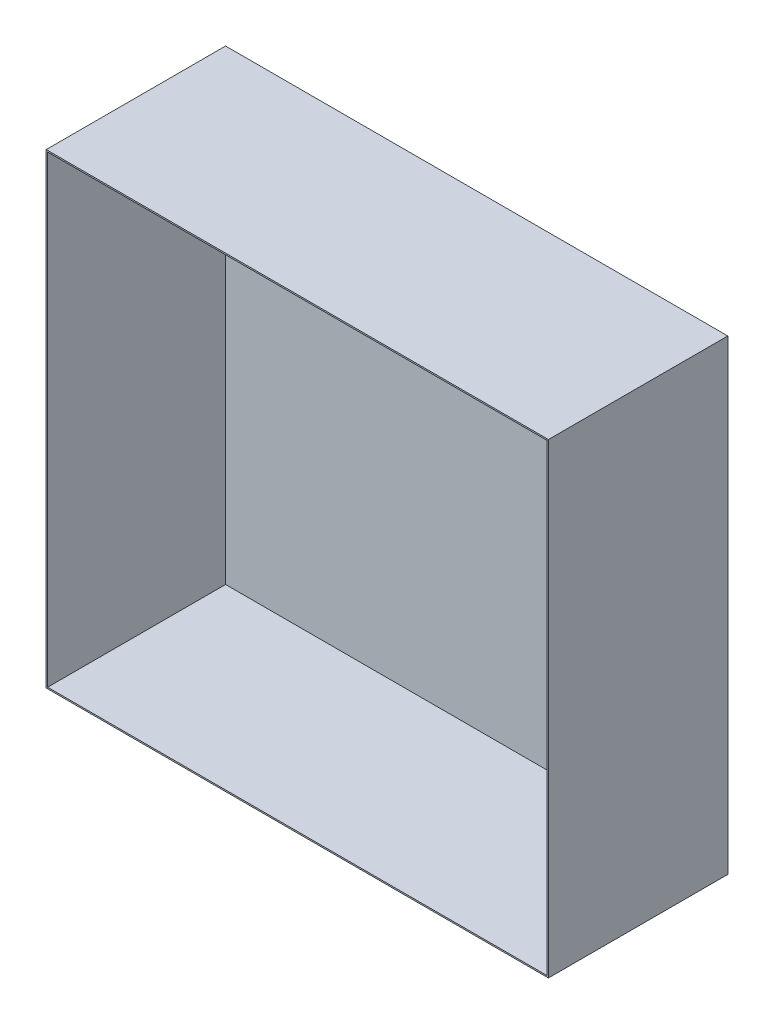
from build123d import *

# Parameters (mm, degrees)
EW_SKETCH_W      = 700
EW_SKETCH_H      = 650
EW_EXTRUDE_DEPTH = 250
COQUE2_T         = -2


with BuildPart() as part:
    # EW_SKETCH → EW_EXTRUDE (new body)
    with BuildSketch(Plane.XY):
        with Locations((0, 325)):
            Rectangle(EW_SKETCH_W, EW_SKETCH_H)
    extrude(amount=EW_EXTRUDE_DEPTH)

    # Coque2
    coque2_openings = [part.faces().sort_by_distance(p)[0] for p in [
        (0, 325, 250),
    ]]
    offset(amount=COQUE2_T, openings=coque2_openings, kind=Kind.INTERSECTION)


solid = part.part
